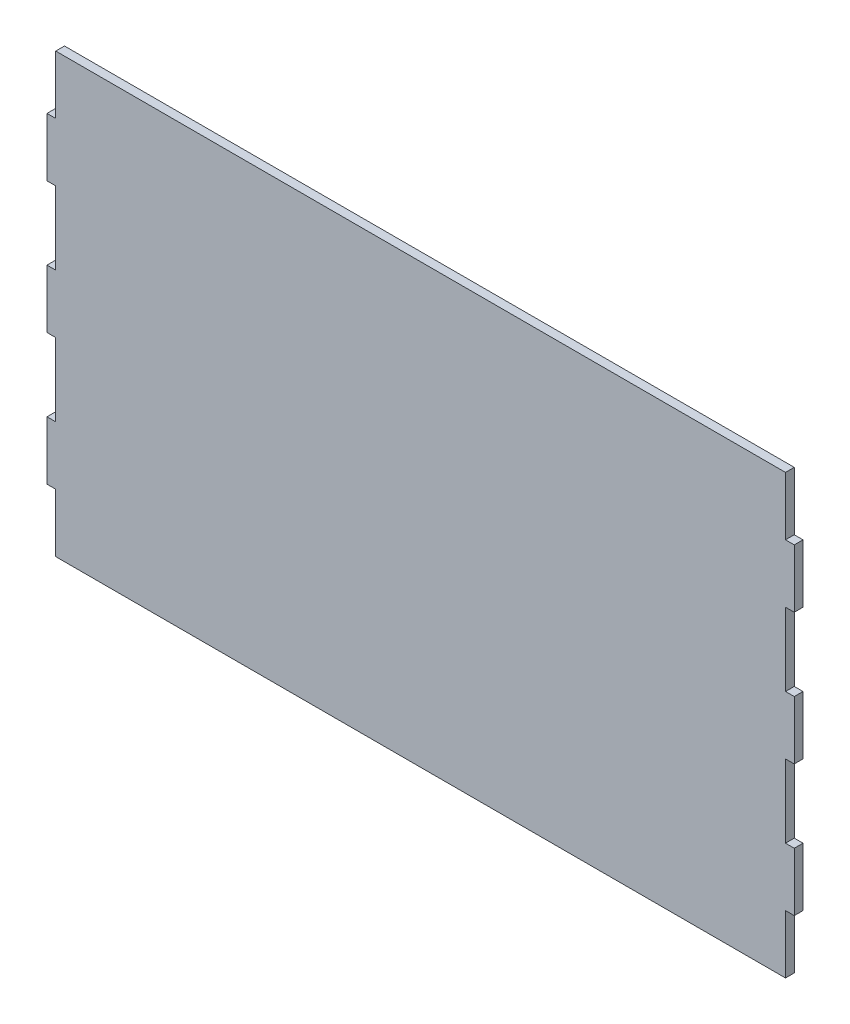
from build123d import *

# Parameters (mm, degrees)
SALIENTE_EXTRUIR1_DEPTH = 12


with BuildPart() as part:
    # Croquis1 → Saliente-Extruir1 (new body)
    with BuildSketch(Plane.XY):
        Polygon((-500, 140), (-512, 140), (-512, 60), (-500, 60), (-500, -40), (-512, -40), (-512, -120), (-500, -120), (-500, -220), (-512, -220), (-512, -300), (-500, -300), (-500, -380), (500, -380), (500, -300), (512, -300), (512, -220), (500, -220), (500, -120), (512, -120), (512, -40), (500, -40), (500, 60), (512, 60), (512, 140), (500, 140), (500, 220), (-500, 220), align=None)
    extrude(amount=SALIENTE_EXTRUIR1_DEPTH)


solid = part.part
